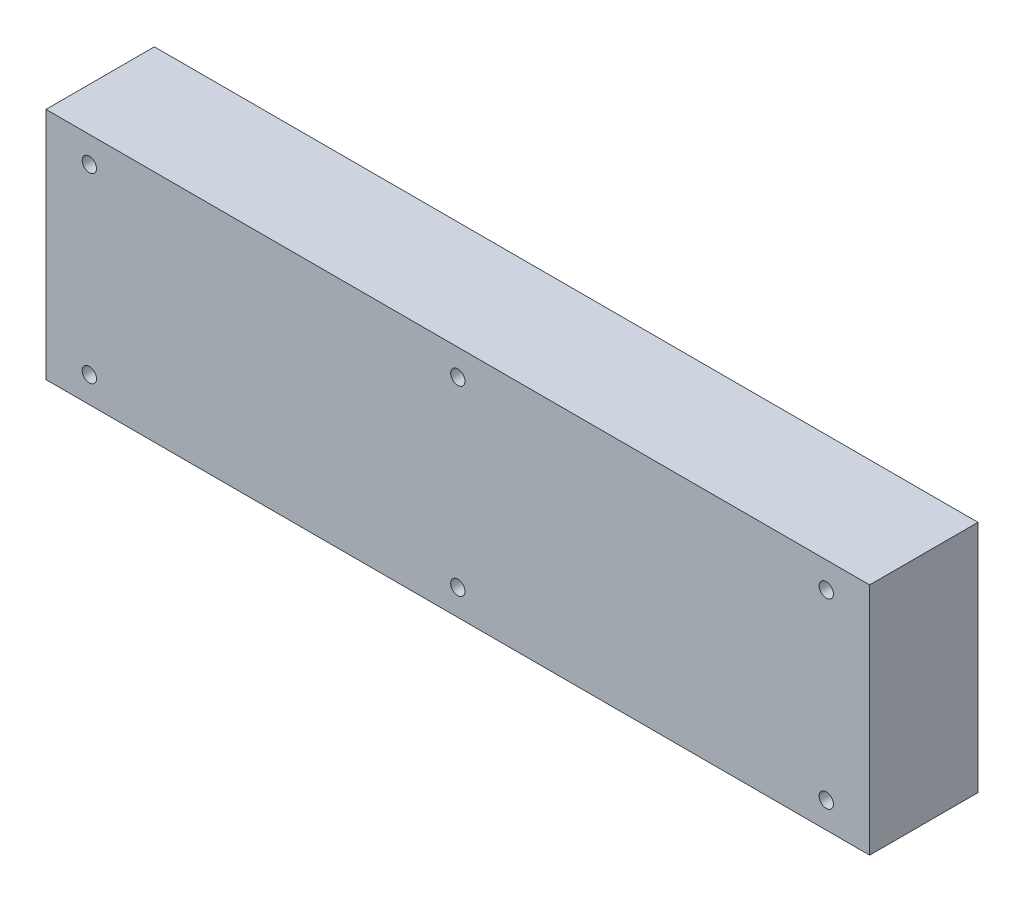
ISO-10303-21;
HEADER;
FILE_DESCRIPTION(('STEP AP214'),'2;1');
FILE_NAME('part.step','',(''),(''),'','','');
FILE_SCHEMA(('AUTOMOTIVE_DESIGN { 1 0 10303 214 1 1 1 1 }'));
ENDSEC;
DATA;
#1=APPLICATION_CONTEXT('core data for automotive mechanical design processes');
#2=APPLICATION_PROTOCOL_DEFINITION('international standard','automotive_design',2000,#1);
#3=PRODUCT_CONTEXT('',#1,'mechanical');
#4=PRODUCT('Part','Part','',(#3));
#5=PRODUCT_RELATED_PRODUCT_CATEGORY('part','',(#4));
#6=PRODUCT_DEFINITION_FORMATION('','',#4);
#7=PRODUCT_DEFINITION_CONTEXT('part definition',#1,'design');
#8=PRODUCT_DEFINITION('design','',#6,#7);
#9=PRODUCT_DEFINITION_SHAPE('','',#8);
#10=(LENGTH_UNIT() NAMED_UNIT(*) SI_UNIT(.MILLI.,.METRE.));
#11=(NAMED_UNIT(*) PLANE_ANGLE_UNIT() SI_UNIT($,.RADIAN.));
#12=(NAMED_UNIT(*) SI_UNIT($,.STERADIAN.) SOLID_ANGLE_UNIT());
#13=UNCERTAINTY_MEASURE_WITH_UNIT(LENGTH_MEASURE(1.E-05),#10,'distance_accuracy_value','');
#14=(GEOMETRIC_REPRESENTATION_CONTEXT(3) GLOBAL_UNCERTAINTY_ASSIGNED_CONTEXT((#13)) GLOBAL_UNIT_ASSIGNED_CONTEXT((#10,
#11,#12)) REPRESENTATION_CONTEXT('',''));
#15=CARTESIAN_POINT('',(0.,0.,0.));
#16=DIRECTION('',(0.,0.,1.));
#17=DIRECTION('',(1.,0.,0.));
#18=AXIS2_PLACEMENT_3D('',#15,#16,#17);
#19=CARTESIAN_POINT('',(0.,0.,25.));
#20=DIRECTION('',(0.,1.,0.));
#21=DIRECTION('',(0.,0.,1.));
#22=AXIS2_PLACEMENT_3D('',#19,#20,#21);
#23=PLANE('',#22);
#24=DIRECTION('',(1.,0.,0.));
#25=VECTOR('',#24,1.);
#26=CARTESIAN_POINT('',(0.,0.,0.));
#27=LINE('',#26,#25);
#28=CARTESIAN_POINT('',(0.,0.,0.));
#29=VERTEX_POINT('',#28);
#30=CARTESIAN_POINT('',(190.,0.,0.));
#31=VERTEX_POINT('',#30);
#32=EDGE_CURVE('E95',#29,#31,#27,.T.);
#33=ORIENTED_EDGE('',*,*,#32,.T.);
#34=DIRECTION('',(0.,0.,-1.));
#35=VECTOR('',#34,1.);
#36=CARTESIAN_POINT('',(190.,0.,25.));
#37=LINE('',#36,#35);
#38=CARTESIAN_POINT('',(190.,0.,25.));
#39=VERTEX_POINT('',#38);
#40=EDGE_CURVE('E11',#39,#31,#37,.T.);
#41=ORIENTED_EDGE('',*,*,#40,.F.);
#42=DIRECTION('',(1.,0.,0.));
#43=VECTOR('',#42,1.);
#44=CARTESIAN_POINT('',(0.,0.,25.));
#45=LINE('',#44,#43);
#46=CARTESIAN_POINT('',(0.,0.,25.));
#47=VERTEX_POINT('',#46);
#48=EDGE_CURVE('E83',#47,#39,#45,.T.);
#49=ORIENTED_EDGE('',*,*,#48,.F.);
#50=DIRECTION('',(0.,0.,-1.));
#51=VECTOR('',#50,1.);
#52=CARTESIAN_POINT('',(0.,0.,25.));
#53=LINE('',#52,#51);
#54=EDGE_CURVE('E91',#47,#29,#53,.T.);
#55=ORIENTED_EDGE('',*,*,#54,.T.);
#56=EDGE_LOOP('',(#33,#41,#49,#55));
#57=FACE_BOUND('',#56,.T.);
#58=ADVANCED_FACE('F32',(#57),#23,.F.);
#59=CARTESIAN_POINT('',(190.,0.,25.));
#60=DIRECTION('',(-1.,0.,0.));
#61=DIRECTION('',(0.,0.,1.));
#62=AXIS2_PLACEMENT_3D('',#59,#60,#61);
#63=PLANE('',#62);
#64=DIRECTION('',(0.,1.,0.));
#65=VECTOR('',#64,1.);
#66=CARTESIAN_POINT('',(190.,0.,0.));
#67=LINE('',#66,#65);
#68=CARTESIAN_POINT('',(190.,54.0000000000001,0.));
#69=VERTEX_POINT('',#68);
#70=EDGE_CURVE('E87',#31,#69,#67,.T.);
#71=ORIENTED_EDGE('',*,*,#70,.T.);
#72=DIRECTION('',(0.,0.,-1.));
#73=VECTOR('',#72,1.);
#74=CARTESIAN_POINT('',(190.,54.0000000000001,25.));
#75=LINE('',#74,#73);
#76=CARTESIAN_POINT('',(190.,54.0000000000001,25.));
#77=VERTEX_POINT('',#76);
#78=EDGE_CURVE('E40',#77,#69,#75,.T.);
#79=ORIENTED_EDGE('',*,*,#78,.F.);
#80=DIRECTION('',(0.,1.,0.));
#81=VECTOR('',#80,1.);
#82=CARTESIAN_POINT('',(190.,0.,25.));
#83=LINE('',#82,#81);
#84=EDGE_CURVE('E78',#39,#77,#83,.T.);
#85=ORIENTED_EDGE('',*,*,#84,.F.);
#86=ORIENTED_EDGE('',*,*,#40,.T.);
#87=EDGE_LOOP('',(#71,#79,#85,#86));
#88=FACE_BOUND('',#87,.T.);
#89=ADVANCED_FACE('F86',(#88),#63,.F.);
#90=CARTESIAN_POINT('',(0.,54.0000000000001,25.));
#91=DIRECTION('',(0.,-1.,0.));
#92=DIRECTION('',(0.,0.,-1.));
#93=AXIS2_PLACEMENT_3D('',#90,#91,#92);
#94=PLANE('',#93);
#95=DIRECTION('',(-1.,0.,0.));
#96=VECTOR('',#95,1.);
#97=CARTESIAN_POINT('',(0.,54.0000000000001,0.));
#98=LINE('',#97,#96);
#99=CARTESIAN_POINT('',(0.,54.0000000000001,0.));
#100=VERTEX_POINT('',#99);
#101=EDGE_CURVE('E65',#69,#100,#98,.T.);
#102=ORIENTED_EDGE('',*,*,#101,.T.);
#103=DIRECTION('',(0.,0.,-1.));
#104=VECTOR('',#103,1.);
#105=CARTESIAN_POINT('',(0.,54.0000000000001,25.));
#106=LINE('',#105,#104);
#107=CARTESIAN_POINT('',(0.,54.0000000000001,25.));
#108=VERTEX_POINT('',#107);
#109=EDGE_CURVE('E88',#108,#100,#106,.T.);
#110=ORIENTED_EDGE('',*,*,#109,.F.);
#111=DIRECTION('',(-1.,0.,0.));
#112=VECTOR('',#111,1.);
#113=CARTESIAN_POINT('',(0.,54.0000000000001,25.));
#114=LINE('',#113,#112);
#115=EDGE_CURVE('E81',#77,#108,#114,.T.);
#116=ORIENTED_EDGE('',*,*,#115,.F.);
#117=ORIENTED_EDGE('',*,*,#78,.T.);
#118=EDGE_LOOP('',(#102,#110,#116,#117));
#119=FACE_BOUND('',#118,.T.);
#120=ADVANCED_FACE('F89',(#119),#94,.F.);
#121=CARTESIAN_POINT('',(0.,0.,25.));
#122=DIRECTION('',(1.,0.,0.));
#123=DIRECTION('',(0.,0.,-1.));
#124=AXIS2_PLACEMENT_3D('',#121,#122,#123);
#125=PLANE('',#124);
#126=DIRECTION('',(0.,-1.,0.));
#127=VECTOR('',#126,1.);
#128=CARTESIAN_POINT('',(0.,0.,0.));
#129=LINE('',#128,#127);
#130=EDGE_CURVE('E71',#100,#29,#129,.T.);
#131=ORIENTED_EDGE('',*,*,#130,.T.);
#132=ORIENTED_EDGE('',*,*,#54,.F.);
#133=DIRECTION('',(0.,-1.,0.));
#134=VECTOR('',#133,1.);
#135=CARTESIAN_POINT('',(0.,0.,25.));
#136=LINE('',#135,#134);
#137=EDGE_CURVE('E48',#108,#47,#136,.T.);
#138=ORIENTED_EDGE('',*,*,#137,.F.);
#139=ORIENTED_EDGE('',*,*,#109,.T.);
#140=EDGE_LOOP('',(#131,#132,#138,#139));
#141=FACE_BOUND('',#140,.T.);
#142=ADVANCED_FACE('F103',(#141),#125,.F.);
#143=CARTESIAN_POINT('',(190.,0.,25.));
#144=DIRECTION('',(0.,0.,1.));
#145=DIRECTION('',(1.,0.,0.));
#146=AXIS2_PLACEMENT_3D('',#143,#144,#145);
#147=PLANE('',#146);
#148=CARTESIAN_POINT('',(10.,6.,25.));
#149=DIRECTION('',(0.,0.,1.));
#150=DIRECTION('',(1.,0.,0.));
#151=AXIS2_PLACEMENT_3D('',#148,#149,#150);
#152=CIRCLE('',#151,1.65);
#153=CARTESIAN_POINT('',(11.65,6.,25.));
#154=VERTEX_POINT('',#153);
#155=EDGE_CURVE('E139',#154,#154,#152,.T.);
#156=ORIENTED_EDGE('',*,*,#155,.F.);
#157=EDGE_LOOP('',(#156));
#158=FACE_BOUND('',#157,.T.);
#159=CARTESIAN_POINT('',(95.,6.,25.));
#160=DIRECTION('',(0.,0.,1.));
#161=DIRECTION('',(1.,0.,0.));
#162=AXIS2_PLACEMENT_3D('',#159,#160,#161);
#163=CIRCLE('',#162,1.65);
#164=CARTESIAN_POINT('',(96.65,6.,25.));
#165=VERTEX_POINT('',#164);
#166=EDGE_CURVE('E133',#165,#165,#163,.T.);
#167=ORIENTED_EDGE('',*,*,#166,.F.);
#168=EDGE_LOOP('',(#167));
#169=FACE_BOUND('',#168,.T.);
#170=CARTESIAN_POINT('',(180.,6.,25.));
#171=DIRECTION('',(0.,0.,1.));
#172=DIRECTION('',(1.,0.,0.));
#173=AXIS2_PLACEMENT_3D('',#170,#171,#172);
#174=CIRCLE('',#173,1.65000000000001);
#175=CARTESIAN_POINT('',(181.65,6.,25.));
#176=VERTEX_POINT('',#175);
#177=EDGE_CURVE('E127',#176,#176,#174,.T.);
#178=ORIENTED_EDGE('',*,*,#177,.F.);
#179=EDGE_LOOP('',(#178));
#180=FACE_BOUND('',#179,.T.);
#181=CARTESIAN_POINT('',(180.,48.,25.));
#182=DIRECTION('',(0.,0.,1.));
#183=DIRECTION('',(1.,0.,0.));
#184=AXIS2_PLACEMENT_3D('',#181,#182,#183);
#185=CIRCLE('',#184,1.65000000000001);
#186=CARTESIAN_POINT('',(181.65,48.,25.));
#187=VERTEX_POINT('',#186);
#188=EDGE_CURVE('E121',#187,#187,#185,.T.);
#189=ORIENTED_EDGE('',*,*,#188,.F.);
#190=EDGE_LOOP('',(#189));
#191=FACE_BOUND('',#190,.T.);
#192=CARTESIAN_POINT('',(95.,48.,25.));
#193=DIRECTION('',(0.,0.,1.));
#194=DIRECTION('',(1.,0.,0.));
#195=AXIS2_PLACEMENT_3D('',#192,#193,#194);
#196=CIRCLE('',#195,1.65);
#197=CARTESIAN_POINT('',(96.65,48.,25.));
#198=VERTEX_POINT('',#197);
#199=EDGE_CURVE('E115',#198,#198,#196,.T.);
#200=ORIENTED_EDGE('',*,*,#199,.F.);
#201=EDGE_LOOP('',(#200));
#202=FACE_BOUND('',#201,.T.);
#203=CARTESIAN_POINT('',(10.,48.,25.));
#204=DIRECTION('',(0.,0.,1.));
#205=DIRECTION('',(1.,0.,0.));
#206=AXIS2_PLACEMENT_3D('',#203,#204,#205);
#207=CIRCLE('',#206,1.65);
#208=CARTESIAN_POINT('',(11.65,48.,25.));
#209=VERTEX_POINT('',#208);
#210=EDGE_CURVE('E109',#209,#209,#207,.T.);
#211=ORIENTED_EDGE('',*,*,#210,.F.);
#212=EDGE_LOOP('',(#211));
#213=FACE_BOUND('',#212,.T.);
#214=ORIENTED_EDGE('',*,*,#48,.T.);
#215=ORIENTED_EDGE('',*,*,#84,.T.);
#216=ORIENTED_EDGE('',*,*,#115,.T.);
#217=ORIENTED_EDGE('',*,*,#137,.T.);
#218=EDGE_LOOP('',(#214,#215,#216,#217));
#219=FACE_BOUND('',#218,.T.);
#220=ADVANCED_FACE('F79',(#158,#169,#180,#191,#202,#213,#219),#147,.T.);
#221=CARTESIAN_POINT('',(190.,0.,0.));
#222=DIRECTION('',(0.,0.,1.));
#223=DIRECTION('',(1.,0.,0.));
#224=AXIS2_PLACEMENT_3D('',#221,#222,#223);
#225=PLANE('',#224);
#226=CARTESIAN_POINT('',(20.,26.9999999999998,0.));
#227=DIRECTION('',(0.,0.,-1.));
#228=DIRECTION('',(-1.,0.,0.));
#229=AXIS2_PLACEMENT_3D('',#226,#227,#228);
#230=CIRCLE('',#229,2.5);
#231=CARTESIAN_POINT('',(17.5,26.9999999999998,0.));
#232=VERTEX_POINT('',#231);
#233=EDGE_CURVE('E157',#232,#232,#230,.T.);
#234=ORIENTED_EDGE('',*,*,#233,.F.);
#235=EDGE_LOOP('',(#234));
#236=FACE_BOUND('',#235,.T.);
#237=CARTESIAN_POINT('',(95.,26.9999999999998,0.));
#238=DIRECTION('',(0.,0.,-1.));
#239=DIRECTION('',(-1.,0.,0.));
#240=AXIS2_PLACEMENT_3D('',#237,#238,#239);
#241=CIRCLE('',#240,2.50000000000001);
#242=CARTESIAN_POINT('',(92.5,26.9999999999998,0.));
#243=VERTEX_POINT('',#242);
#244=EDGE_CURVE('E151',#243,#243,#241,.T.);
#245=ORIENTED_EDGE('',*,*,#244,.F.);
#246=EDGE_LOOP('',(#245));
#247=FACE_BOUND('',#246,.T.);
#248=CARTESIAN_POINT('',(170.,26.9999999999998,0.));
#249=DIRECTION('',(0.,0.,-1.));
#250=DIRECTION('',(-1.,0.,0.));
#251=AXIS2_PLACEMENT_3D('',#248,#249,#250);
#252=CIRCLE('',#251,2.5);
#253=CARTESIAN_POINT('',(167.5,26.9999999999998,0.));
#254=VERTEX_POINT('',#253);
#255=EDGE_CURVE('E145',#254,#254,#252,.T.);
#256=ORIENTED_EDGE('',*,*,#255,.F.);
#257=EDGE_LOOP('',(#256));
#258=FACE_BOUND('',#257,.T.);
#259=ORIENTED_EDGE('',*,*,#32,.F.);
#260=ORIENTED_EDGE('',*,*,#130,.F.);
#261=ORIENTED_EDGE('',*,*,#101,.F.);
#262=ORIENTED_EDGE('',*,*,#70,.F.);
#263=EDGE_LOOP('',(#259,#260,#261,#262));
#264=FACE_BOUND('',#263,.T.);
#265=ADVANCED_FACE('F106',(#236,#247,#258,#264),#225,.F.);
#266=CARTESIAN_POINT('',(10.,48.,10.));
#267=DIRECTION('',(0.,0.,1.));
#268=DIRECTION('',(1.,0.,0.));
#269=AXIS2_PLACEMENT_3D('',#266,#267,#268);
#270=CYLINDRICAL_SURFACE('',#269,1.65);
#271=CARTESIAN_POINT('',(10.,48.,10.));
#272=DIRECTION('',(0.,0.,1.));
#273=DIRECTION('',(1.,0.,0.));
#274=AXIS2_PLACEMENT_3D('',#271,#272,#273);
#275=CIRCLE('',#274,1.65);
#276=CARTESIAN_POINT('',(11.65,48.,10.));
#277=VERTEX_POINT('',#276);
#278=EDGE_CURVE('E98',#277,#277,#275,.T.);
#279=ORIENTED_EDGE('',*,*,#278,.F.);
#280=EDGE_LOOP('',(#279));
#281=FACE_BOUND('',#280,.T.);
#282=ORIENTED_EDGE('',*,*,#210,.T.);
#283=EDGE_LOOP('',(#282));
#284=FACE_BOUND('',#283,.T.);
#285=ADVANCED_FACE('F174',(#281,#284),#270,.F.);
#286=CARTESIAN_POINT('',(10.,48.,10.));
#287=DIRECTION('',(0.,0.,1.));
#288=DIRECTION('',(1.,0.,0.));
#289=AXIS2_PLACEMENT_3D('',#286,#287,#288);
#290=PLANE('',#289);
#291=ORIENTED_EDGE('',*,*,#278,.T.);
#292=EDGE_LOOP('',(#291));
#293=FACE_BOUND('',#292,.T.);
#294=ADVANCED_FACE('F213',(#293),#290,.T.);
#295=CARTESIAN_POINT('',(95.,48.,10.));
#296=DIRECTION('',(0.,0.,1.));
#297=DIRECTION('',(1.,0.,0.));
#298=AXIS2_PLACEMENT_3D('',#295,#296,#297);
#299=CYLINDRICAL_SURFACE('',#298,1.65);
#300=CARTESIAN_POINT('',(95.,48.,10.));
#301=DIRECTION('',(0.,0.,1.));
#302=DIRECTION('',(1.,0.,0.));
#303=AXIS2_PLACEMENT_3D('',#300,#301,#302);
#304=CIRCLE('',#303,1.65);
#305=CARTESIAN_POINT('',(96.65,48.,10.));
#306=VERTEX_POINT('',#305);
#307=EDGE_CURVE('E112',#306,#306,#304,.T.);
#308=ORIENTED_EDGE('',*,*,#307,.F.);
#309=EDGE_LOOP('',(#308));
#310=FACE_BOUND('',#309,.T.);
#311=ORIENTED_EDGE('',*,*,#199,.T.);
#312=EDGE_LOOP('',(#311));
#313=FACE_BOUND('',#312,.T.);
#314=ADVANCED_FACE('F217',(#310,#313),#299,.F.);
#315=CARTESIAN_POINT('',(95.,48.,10.));
#316=DIRECTION('',(0.,0.,1.));
#317=DIRECTION('',(1.,0.,0.));
#318=AXIS2_PLACEMENT_3D('',#315,#316,#317);
#319=PLANE('',#318);
#320=ORIENTED_EDGE('',*,*,#307,.T.);
#321=EDGE_LOOP('',(#320));
#322=FACE_BOUND('',#321,.T.);
#323=ADVANCED_FACE('F221',(#322),#319,.T.);
#324=CARTESIAN_POINT('',(180.,48.,10.));
#325=DIRECTION('',(0.,0.,1.));
#326=DIRECTION('',(1.,0.,0.));
#327=AXIS2_PLACEMENT_3D('',#324,#325,#326);
#328=CYLINDRICAL_SURFACE('',#327,1.65000000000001);
#329=CARTESIAN_POINT('',(180.,48.,10.));
#330=DIRECTION('',(0.,0.,1.));
#331=DIRECTION('',(1.,0.,0.));
#332=AXIS2_PLACEMENT_3D('',#329,#330,#331);
#333=CIRCLE('',#332,1.65000000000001);
#334=CARTESIAN_POINT('',(181.65,48.,10.));
#335=VERTEX_POINT('',#334);
#336=EDGE_CURVE('E118',#335,#335,#333,.T.);
#337=ORIENTED_EDGE('',*,*,#336,.F.);
#338=EDGE_LOOP('',(#337));
#339=FACE_BOUND('',#338,.T.);
#340=ORIENTED_EDGE('',*,*,#188,.T.);
#341=EDGE_LOOP('',(#340));
#342=FACE_BOUND('',#341,.T.);
#343=ADVANCED_FACE('F225',(#339,#342),#328,.F.);
#344=CARTESIAN_POINT('',(180.,48.,10.));
#345=DIRECTION('',(0.,0.,1.));
#346=DIRECTION('',(1.,0.,0.));
#347=AXIS2_PLACEMENT_3D('',#344,#345,#346);
#348=PLANE('',#347);
#349=ORIENTED_EDGE('',*,*,#336,.T.);
#350=EDGE_LOOP('',(#349));
#351=FACE_BOUND('',#350,.T.);
#352=ADVANCED_FACE('F229',(#351),#348,.T.);
#353=CARTESIAN_POINT('',(180.,6.,10.));
#354=DIRECTION('',(0.,0.,1.));
#355=DIRECTION('',(1.,0.,0.));
#356=AXIS2_PLACEMENT_3D('',#353,#354,#355);
#357=CYLINDRICAL_SURFACE('',#356,1.65000000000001);
#358=CARTESIAN_POINT('',(180.,6.,10.));
#359=DIRECTION('',(0.,0.,1.));
#360=DIRECTION('',(1.,0.,0.));
#361=AXIS2_PLACEMENT_3D('',#358,#359,#360);
#362=CIRCLE('',#361,1.65000000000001);
#363=CARTESIAN_POINT('',(181.65,6.,10.));
#364=VERTEX_POINT('',#363);
#365=EDGE_CURVE('E124',#364,#364,#362,.T.);
#366=ORIENTED_EDGE('',*,*,#365,.F.);
#367=EDGE_LOOP('',(#366));
#368=FACE_BOUND('',#367,.T.);
#369=ORIENTED_EDGE('',*,*,#177,.T.);
#370=EDGE_LOOP('',(#369));
#371=FACE_BOUND('',#370,.T.);
#372=ADVANCED_FACE('F233',(#368,#371),#357,.F.);
#373=CARTESIAN_POINT('',(180.,6.,10.));
#374=DIRECTION('',(0.,0.,1.));
#375=DIRECTION('',(1.,0.,0.));
#376=AXIS2_PLACEMENT_3D('',#373,#374,#375);
#377=PLANE('',#376);
#378=ORIENTED_EDGE('',*,*,#365,.T.);
#379=EDGE_LOOP('',(#378));
#380=FACE_BOUND('',#379,.T.);
#381=ADVANCED_FACE('F237',(#380),#377,.T.);
#382=CARTESIAN_POINT('',(95.,6.,10.));
#383=DIRECTION('',(0.,0.,1.));
#384=DIRECTION('',(1.,0.,0.));
#385=AXIS2_PLACEMENT_3D('',#382,#383,#384);
#386=CYLINDRICAL_SURFACE('',#385,1.65);
#387=CARTESIAN_POINT('',(95.,6.,10.));
#388=DIRECTION('',(0.,0.,1.));
#389=DIRECTION('',(1.,0.,0.));
#390=AXIS2_PLACEMENT_3D('',#387,#388,#389);
#391=CIRCLE('',#390,1.65);
#392=CARTESIAN_POINT('',(96.65,6.,10.));
#393=VERTEX_POINT('',#392);
#394=EDGE_CURVE('E130',#393,#393,#391,.T.);
#395=ORIENTED_EDGE('',*,*,#394,.F.);
#396=EDGE_LOOP('',(#395));
#397=FACE_BOUND('',#396,.T.);
#398=ORIENTED_EDGE('',*,*,#166,.T.);
#399=EDGE_LOOP('',(#398));
#400=FACE_BOUND('',#399,.T.);
#401=ADVANCED_FACE('F241',(#397,#400),#386,.F.);
#402=CARTESIAN_POINT('',(95.,6.,10.));
#403=DIRECTION('',(0.,0.,1.));
#404=DIRECTION('',(1.,0.,0.));
#405=AXIS2_PLACEMENT_3D('',#402,#403,#404);
#406=PLANE('',#405);
#407=ORIENTED_EDGE('',*,*,#394,.T.);
#408=EDGE_LOOP('',(#407));
#409=FACE_BOUND('',#408,.T.);
#410=ADVANCED_FACE('F245',(#409),#406,.T.);
#411=CARTESIAN_POINT('',(10.,6.,10.));
#412=DIRECTION('',(0.,0.,1.));
#413=DIRECTION('',(1.,0.,0.));
#414=AXIS2_PLACEMENT_3D('',#411,#412,#413);
#415=CYLINDRICAL_SURFACE('',#414,1.65);
#416=CARTESIAN_POINT('',(10.,6.,10.));
#417=DIRECTION('',(0.,0.,1.));
#418=DIRECTION('',(1.,0.,0.));
#419=AXIS2_PLACEMENT_3D('',#416,#417,#418);
#420=CIRCLE('',#419,1.65);
#421=CARTESIAN_POINT('',(11.65,6.,10.));
#422=VERTEX_POINT('',#421);
#423=EDGE_CURVE('E136',#422,#422,#420,.T.);
#424=ORIENTED_EDGE('',*,*,#423,.F.);
#425=EDGE_LOOP('',(#424));
#426=FACE_BOUND('',#425,.T.);
#427=ORIENTED_EDGE('',*,*,#155,.T.);
#428=EDGE_LOOP('',(#427));
#429=FACE_BOUND('',#428,.T.);
#430=ADVANCED_FACE('F193',(#426,#429),#415,.F.);
#431=CARTESIAN_POINT('',(10.,6.,10.));
#432=DIRECTION('',(0.,0.,1.));
#433=DIRECTION('',(1.,0.,0.));
#434=AXIS2_PLACEMENT_3D('',#431,#432,#433);
#435=PLANE('',#434);
#436=ORIENTED_EDGE('',*,*,#423,.T.);
#437=EDGE_LOOP('',(#436));
#438=FACE_BOUND('',#437,.T.);
#439=ADVANCED_FACE('F183',(#438),#435,.T.);
#440=CARTESIAN_POINT('',(170.,26.9999999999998,15.));
#441=DIRECTION('',(0.,0.,-1.));
#442=DIRECTION('',(-1.,0.,0.));
#443=AXIS2_PLACEMENT_3D('',#440,#441,#442);
#444=CYLINDRICAL_SURFACE('',#443,2.5);
#445=CARTESIAN_POINT('',(170.,26.9999999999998,15.));
#446=DIRECTION('',(0.,0.,-1.));
#447=DIRECTION('',(-1.,0.,0.));
#448=AXIS2_PLACEMENT_3D('',#445,#446,#447);
#449=CIRCLE('',#448,2.5);
#450=CARTESIAN_POINT('',(167.5,26.9999999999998,15.));
#451=VERTEX_POINT('',#450);
#452=EDGE_CURVE('E142',#451,#451,#449,.T.);
#453=ORIENTED_EDGE('',*,*,#452,.F.);
#454=EDGE_LOOP('',(#453));
#455=FACE_BOUND('',#454,.T.);
#456=ORIENTED_EDGE('',*,*,#255,.T.);
#457=EDGE_LOOP('',(#456));
#458=FACE_BOUND('',#457,.T.);
#459=ADVANCED_FACE('F180',(#455,#458),#444,.F.);
#460=CARTESIAN_POINT('',(170.,26.9999999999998,15.));
#461=DIRECTION('',(0.,0.,-1.));
#462=DIRECTION('',(-1.,0.,0.));
#463=AXIS2_PLACEMENT_3D('',#460,#461,#462);
#464=PLANE('',#463);
#465=ORIENTED_EDGE('',*,*,#452,.T.);
#466=EDGE_LOOP('',(#465));
#467=FACE_BOUND('',#466,.T.);
#468=ADVANCED_FACE('F182',(#467),#464,.T.);
#469=CARTESIAN_POINT('',(95.,26.9999999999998,15.));
#470=DIRECTION('',(0.,0.,-1.));
#471=DIRECTION('',(-1.,0.,0.));
#472=AXIS2_PLACEMENT_3D('',#469,#470,#471);
#473=CYLINDRICAL_SURFACE('',#472,2.50000000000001);
#474=CARTESIAN_POINT('',(95.,26.9999999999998,15.));
#475=DIRECTION('',(0.,0.,-1.));
#476=DIRECTION('',(-1.,0.,0.));
#477=AXIS2_PLACEMENT_3D('',#474,#475,#476);
#478=CIRCLE('',#477,2.50000000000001);
#479=CARTESIAN_POINT('',(92.5,26.9999999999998,15.));
#480=VERTEX_POINT('',#479);
#481=EDGE_CURVE('E148',#480,#480,#478,.T.);
#482=ORIENTED_EDGE('',*,*,#481,.F.);
#483=EDGE_LOOP('',(#482));
#484=FACE_BOUND('',#483,.T.);
#485=ORIENTED_EDGE('',*,*,#244,.T.);
#486=EDGE_LOOP('',(#485));
#487=FACE_BOUND('',#486,.T.);
#488=ADVANCED_FACE('F190',(#484,#487),#473,.F.);
#489=CARTESIAN_POINT('',(95.,26.9999999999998,15.));
#490=DIRECTION('',(0.,0.,-1.));
#491=DIRECTION('',(-1.,0.,0.));
#492=AXIS2_PLACEMENT_3D('',#489,#490,#491);
#493=PLANE('',#492);
#494=ORIENTED_EDGE('',*,*,#481,.T.);
#495=EDGE_LOOP('',(#494));
#496=FACE_BOUND('',#495,.T.);
#497=ADVANCED_FACE('F168',(#496),#493,.T.);
#498=CARTESIAN_POINT('',(20.,26.9999999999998,15.));
#499=DIRECTION('',(0.,0.,-1.));
#500=DIRECTION('',(-1.,0.,0.));
#501=AXIS2_PLACEMENT_3D('',#498,#499,#500);
#502=CYLINDRICAL_SURFACE('',#501,2.5);
#503=CARTESIAN_POINT('',(20.,26.9999999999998,15.));
#504=DIRECTION('',(0.,0.,-1.));
#505=DIRECTION('',(-1.,0.,0.));
#506=AXIS2_PLACEMENT_3D('',#503,#504,#505);
#507=CIRCLE('',#506,2.5);
#508=CARTESIAN_POINT('',(17.5,26.9999999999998,15.));
#509=VERTEX_POINT('',#508);
#510=EDGE_CURVE('E154',#509,#509,#507,.T.);
#511=ORIENTED_EDGE('',*,*,#510,.F.);
#512=EDGE_LOOP('',(#511));
#513=FACE_BOUND('',#512,.T.);
#514=ORIENTED_EDGE('',*,*,#233,.T.);
#515=EDGE_LOOP('',(#514));
#516=FACE_BOUND('',#515,.T.);
#517=ADVANCED_FACE('F165',(#513,#516),#502,.F.);
#518=CARTESIAN_POINT('',(20.,26.9999999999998,15.));
#519=DIRECTION('',(0.,0.,-1.));
#520=DIRECTION('',(-1.,0.,0.));
#521=AXIS2_PLACEMENT_3D('',#518,#519,#520);
#522=PLANE('',#521);
#523=ORIENTED_EDGE('',*,*,#510,.T.);
#524=EDGE_LOOP('',(#523));
#525=FACE_BOUND('',#524,.T.);
#526=ADVANCED_FACE('F163',(#525),#522,.T.);
#527=CLOSED_SHELL('',(#58,#89,#120,#142,#220,#265,#285,#294,#314,#323,#343,#352,#372,#381,#401,
#410,#430,#439,#459,#468,#488,#497,#517,#526));
#528=MANIFOLD_SOLID_BREP('B2',#527);
#529=ADVANCED_BREP_SHAPE_REPRESENTATION('',(#18,#528),#14);
#530=SHAPE_DEFINITION_REPRESENTATION(#9,#529);
ENDSEC;
END-ISO-10303-21;
